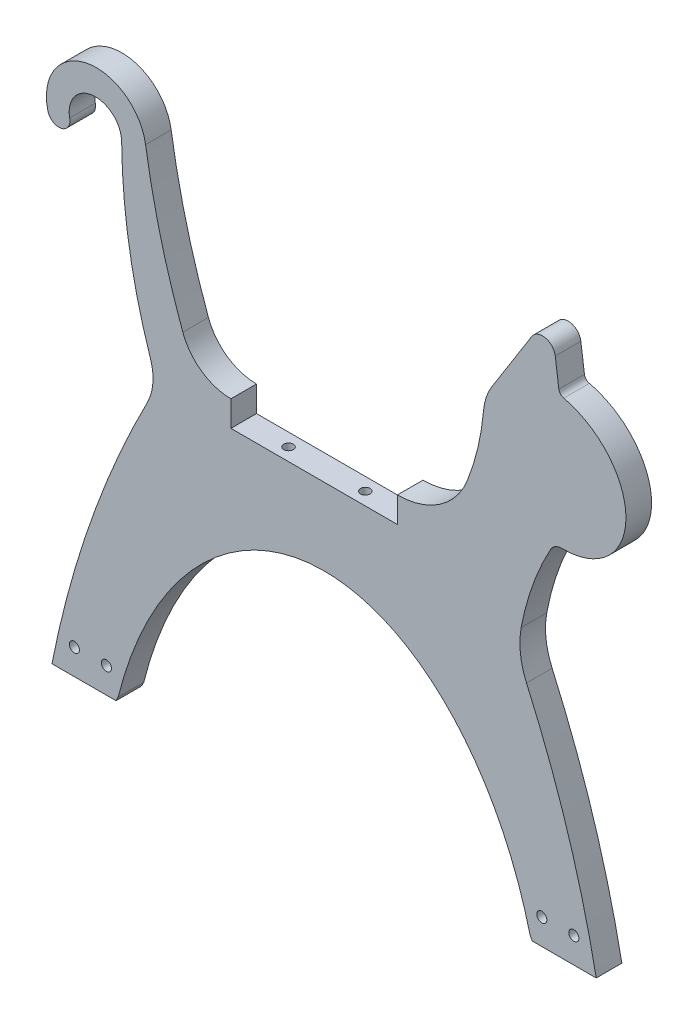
from build123d import *

# Parameters (mm, degrees)
BOSS_EXTRUDE1_DEPTH                  = 12.7
BOSS_EXTRUDE2_DEPTH                  = 25.4
FILLET1_R                            = 74.6125
FILLET2_R                            = 76.2
FILLET3_R                            = 12.7
FILLET4_R                            = 50.8
CUT_EXTRUDE2_DEPTH                   = 803.474994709
SKETCH8_W                            = 165.1
SKETCH8_H                            = 25.4
CUT_EXTRUDE3_DEPTH                   = 656.204912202
F_1_4_0_25_DIAMETER_HOLE1_AT_2_COUNT = 2
F_1_4_0_25_DIAMETER_HOLE1_AT_2_PITCH = 31.75
SKETCH11_R                           = 5
CUT_EXTRUDE4_DEPTH                   = 19.05
F_3_8_0_375_DIAMETER_HOLE2_D         = 9.525
F_3_8_0_375_DIAMETER_HOLE2_DEPTH     = 38.1
F_3_8_0_375_DIAMETER_HOLE2_TIP       = 2.861598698
F_3_8_0_375_DIAMETER_HOLE3_D         = 9.525
F_3_8_0_375_DIAMETER_HOLE3_DEPTH     = 50.8
F_3_8_0_375_DIAMETER_HOLE3_TIP       = 2.861598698
FILLET5_R                            = 6.35
F_3_8_0_375_DIAMETER_HOLE4_D         = 9.525
F_3_8_0_375_DIAMETER_HOLE4_DEPTH     = 50.8
F_3_8_0_375_DIAMETER_HOLE4_TIP       = 2.861598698


with BuildPart() as part:
    # Sketch1 → Boss-Extrude1 (new, symmetric)
    with BuildSketch(Plane.XY):
        with BuildLine():
            Line((-62.161198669, 38.304368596), (-22.703003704, 101.033702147))
            ThreePointArc((-22.703003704, 101.033702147), (-9.24985601, 106.680653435), (0.635725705, 95.949832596))
            Line((0.635725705, 95.949832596), (4.782812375, 64.841198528))
            add(Edge.make_bspline(
                [(-62.161198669, 38.304368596), (-177.562601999, -145.156966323), (34.078918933, -61.261559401), (245.720439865, 22.633847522), (4.782812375, 64.841198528)],
                knots=[3.108642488, 3.108642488, 3.108642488, 5.680132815, 5.680132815, 8.251623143, 8.251623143, 8.251623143], degree=2, weights=[1, 0.28120655, 1, 0.28120655, 1]))
        make_face()
    extrude(amount=BOSS_EXTRUDE1_DEPTH, both=True)

    # Sketch4 → Boss-Extrude2 (add)
    with BuildSketch(Plane.XY.offset(12.7)):
        with BuildLine():
            Line((-111.394663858, -101.6), (-355.6, -101.6))
            ThreePointArc((-355.6, -101.6), (-386.013830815, -15.177224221), (-405.665165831, 74.308653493))
            ThreePointArc((-405.665165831, 74.308653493), (-464.259473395, 115.158457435), (-502.551122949, 54.861285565))
            ThreePointArc((-502.551122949, 54.861285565), (-496.459754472, 47.386282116), (-486.817132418, 47.369358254))
            ThreePointArc((-486.817132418, 47.369358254), (-481.763873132, 52.501662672), (-480.941881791, 59.657101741))
            ThreePointArc((-480.941881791, 59.657101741), (-457.997946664, 90.517124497), (-429.369181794, 64.843032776))
            ThreePointArc((-429.369181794, 64.843032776), (-419.965347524, -32.646005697), (-393.7, -127))
            ThreePointArc((-393.7, -127), (-453.753289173, -258.971571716), (-494.409481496, -398.147601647))
            ThreePointArc((-494.409481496, -398.147601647), (-549.078593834, -380.712192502), (-602.615, -360.058898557))
            ThreePointArc((-602.615, -360.058898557), (-635.872990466, -373.631889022), (-622.3, -406.889879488))
            ThreePointArc((-622.3, -406.889879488), (-228.6, -486.270260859), (165.1, -406.889879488))
            ThreePointArc((165.1, -406.889879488), (178.672990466, -373.631889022), (145.415, -360.058898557))
            ThreePointArc((145.415, -360.058898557), (91.878593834, -380.712192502), (37.209481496, -398.147601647))
            ThreePointArc((37.209481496, -398.147601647), (6.453805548, -286.865780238), (-36.728436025, -179.791743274))
            ThreePointArc((-36.728436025, -179.791743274), (-24.715114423, -120.629816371), (-0.067674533, -65.521221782))
            add(Edge.make_bspline(
                [(-70.533204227, 13.219992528), (-76.719579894, -56.83397157), (-0.067674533, -65.521221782)],
                knots=[3.526078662, 3.526078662, 3.526078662, 5.176713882, 5.176713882, 5.176713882], degree=2, weights=[1, 0.678323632, 1]))
            ThreePointArc((-70.533204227, 13.219992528), (-83.638719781, -46.796857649), (-111.394663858, -101.6))
        make_face()
        with BuildLine():
            ThreePointArc((-432.822671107, -413.61756732), (-228.6, -435.470260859), (-24.377328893, -413.61756732))
            add(Edge.make_bspline(
                [(-24.377328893, -413.61756732), (-228.6, 403.273117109), (-432.822671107, -413.61756732)],
                knots=[5.06670914, 5.06670914, 5.06670914, 7.499661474, 7.499661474, 7.499661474], degree=2, weights=[1, 0.346952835, 1]))
        make_face(mode=Mode.SUBTRACT)
    extrude(amount=-BOSS_EXTRUDE2_DEPTH)

    # Fillet1
    fillet1_edges = [part.edges().sort_by_distance(p)[0] for p in [
        (-111.394663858, -101.6, 0),
    ]]
    fillet(fillet1_edges, radius=FILLET1_R)

    # Fillet2
    fillet2_edges = [part.edges().sort_by_distance(p)[0] for p in [
        (-36.728436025, -179.791743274, 0),
    ]]
    fillet(fillet2_edges, radius=FILLET2_R)

    # Fillet3
    fillet3_edges = [part.edges().sort_by_distance(p)[0] for p in [
        (-0.067674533, -65.521221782, -6.35),
    ]]
    fillet(fillet3_edges, radius=FILLET3_R)

    # Fillet4
    fillet4_edges = [part.edges().sort_by_distance(p)[0] for p in [
        (-355.6, -101.6, 0),
        (-393.7, -127, 0),
    ]]
    fillet(fillet4_edges, radius=FILLET4_R)

    # Sketch7 → Cut-Extrude2 (cut, through all)
    with BuildSketch(Plane.XY.offset(12.7)):
        with BuildLine():
            Line((-498.475, -417.912284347), (-434.975, -417.912284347))
            ThreePointArc((-434.975, -417.912284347), (-433.910386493, -415.759136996), (-432.822671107, -413.61756732))
            ThreePointArc((-432.822671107, -413.61756732), (-228.6, -435.470260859), (-24.377328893, -413.61756732))
            ThreePointArc((-24.377328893, -413.61756732), (-23.289999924, -415.759330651), (-22.225, -417.912284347))
            Line((-22.225, -417.912284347), (41.275, -417.912284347))
            ThreePointArc((41.275, -417.912284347), (39.291309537, -408.019849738), (37.209481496, -398.147601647))
            ThreePointArc((37.209481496, -398.147601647), (91.878593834, -380.712192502), (145.415, -360.058898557))
            ThreePointArc((145.415, -360.058898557), (178.672990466, -373.631889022), (165.1, -406.889879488))
            ThreePointArc((165.1, -406.889879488), (-228.6, -486.270260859), (-622.3, -406.889879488))
            ThreePointArc((-622.3, -406.889879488), (-635.872990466, -373.631889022), (-602.615, -360.058898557))
            ThreePointArc((-602.615, -360.058898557), (-549.078593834, -380.712192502), (-494.409481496, -398.147601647))
            ThreePointArc((-494.409481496, -398.147601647), (-496.491309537, -408.019849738), (-498.475, -417.912284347))
        make_face()
    extrude(amount=-CUT_EXTRUDE2_DEPTH, mode=Mode.SUBTRACT)

    # Sketch8 → Cut-Extrude3 (cut, through all)
    with BuildSketch(Plane.XY.offset(12.7)):
        with Locations((-238.491347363, -114.3)):
            Rectangle(SKETCH8_W, SKETCH8_H)
    extrude(amount=-CUT_EXTRUDE3_DEPTH, mode=Mode.SUBTRACT)

    # Sketch9 → 1_4 _0.25_ Diameter Hole1 (revolve, cut)
    with BuildSketch(Plane(origin=(-476.25, -417.912284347, 0), x_dir=(0, 0, -1), z_dir=(1, 0, 0))):
        Polygon((0, 0), (0, 40.007732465), (3.175, 38.1), (3.175, 0), align=None)
    f_1_4_0_25_diameter_hole1 = revolve(axis=Axis((-476.25, -424.262284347, 0), (0, 1, 0)), mode=Mode.SUBTRACT)

    # 1_4 _0.25_ Diameter Hole1 at 2: 1_4 _0.25_ Diameter Hole1 ×2
    with Locations(*[(i * F_1_4_0_25_DIAMETER_HOLE1_AT_2_PITCH, 0, 0) for i in range(1, F_1_4_0_25_DIAMETER_HOLE1_AT_2_COUNT)]):
        add(f_1_4_0_25_diameter_hole1, mode=Mode.SUBTRACT)

    # Sketch11 → Cut-Extrude4 (cut)
    with BuildSketch(Plane.XY.offset(12.7)):
        with Locations((-476.25, -392.512284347)):
            Circle(SKETCH11_R)
        with Locations((-444.5, -392.512284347)):
            Circle(SKETCH11_R)
    cut_extrude4 = extrude(amount=-CUT_EXTRUDE4_DEPTH, mode=Mode.SUBTRACT)

    # Mirror1: 1_4 _0.25_ Diameter Hole1, Cut-Extrude4 across plane
    add(f_1_4_0_25_diameter_hole1.mirror(Plane(origin=(-228.6, 0, 0), x_dir=(0, 0, 1), z_dir=(1, 0, 0))), mode=Mode.SUBTRACT)
    add(cut_extrude4.mirror(Plane(origin=(-228.6, 0, 0), x_dir=(0, 0, 1), z_dir=(1, 0, 0))), mode=Mode.SUBTRACT)

    # Mirror1 copy 1 sketch → Mirror1 copy 1 (revolve, cut)
    with BuildSketch(Plane(origin=(-12.7, -417.912284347, 0), x_dir=(0, 0, -1), z_dir=(-1, 0, 0))):
        Polygon((0, 0), (0, -40.007732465), (3.175, -38.1), (3.175, 0), align=None)
    revolve(axis=Axis((-12.7, -424.262284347, 0), (0, -1, 0)), mode=Mode.SUBTRACT)

    # 3_8 _0.375_ Diameter Hole2
    with Locations(Plane(origin=(0, -127, 0), x_dir=(1, 0, 0), z_dir=(0, 1, 0))):
        with Locations((-200.391347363, 0), (-276.591347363, 0)):
            Hole(F_3_8_0_375_DIAMETER_HOLE2_D / 2, depth=F_3_8_0_375_DIAMETER_HOLE2_DEPTH)
            with Locations((0, 0, -(F_3_8_0_375_DIAMETER_HOLE2_DEPTH + F_3_8_0_375_DIAMETER_HOLE2_TIP / 2))):  # 118° drill point
                Cone(0, F_3_8_0_375_DIAMETER_HOLE2_D / 2, F_3_8_0_375_DIAMETER_HOLE2_TIP, mode=Mode.SUBTRACT)

    # 3_8 _0.375_ Diameter Hole3
    with Locations(Plane(origin=(-61.802238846, 38.875031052, 0), x_dir=(0, 0, 1), z_dir=(-0.8464642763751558, 0.532445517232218, 0))):
        with Locations((0, 8.850828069)):
            Hole(F_3_8_0_375_DIAMETER_HOLE3_D / 2, depth=F_3_8_0_375_DIAMETER_HOLE3_DEPTH)
            with Locations((0, 0, -(F_3_8_0_375_DIAMETER_HOLE3_DEPTH + F_3_8_0_375_DIAMETER_HOLE3_TIP / 2))):  # 118° drill point
                Cone(0, F_3_8_0_375_DIAMETER_HOLE3_D / 2, F_3_8_0_375_DIAMETER_HOLE3_TIP, mode=Mode.SUBTRACT)

    # Fillet5
    fillet5_edges = [part.edges().sort_by_distance(p)[0] for p in [
        (4.782812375, 64.841198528, -6.35),
    ]]
    fillet(fillet5_edges, radius=FILLET5_R)

    # 3_8 _0.375_ Diameter Hole4
    with Locations(Plane(origin=(-78.629429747, -291.802412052, 0), x_dir=(0.579680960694, -0.814843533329, 0), z_dir=(-0.814843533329, -0.579680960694, 0))):
        with Locations((0, 0)):
            Hole(F_3_8_0_375_DIAMETER_HOLE4_D / 2, depth=F_3_8_0_375_DIAMETER_HOLE4_DEPTH)
            with Locations((0, 0, -(F_3_8_0_375_DIAMETER_HOLE4_DEPTH + F_3_8_0_375_DIAMETER_HOLE4_TIP / 2))):  # 118° drill point
                Cone(0, F_3_8_0_375_DIAMETER_HOLE4_D / 2, F_3_8_0_375_DIAMETER_HOLE4_TIP, mode=Mode.SUBTRACT)


solid = part.part
